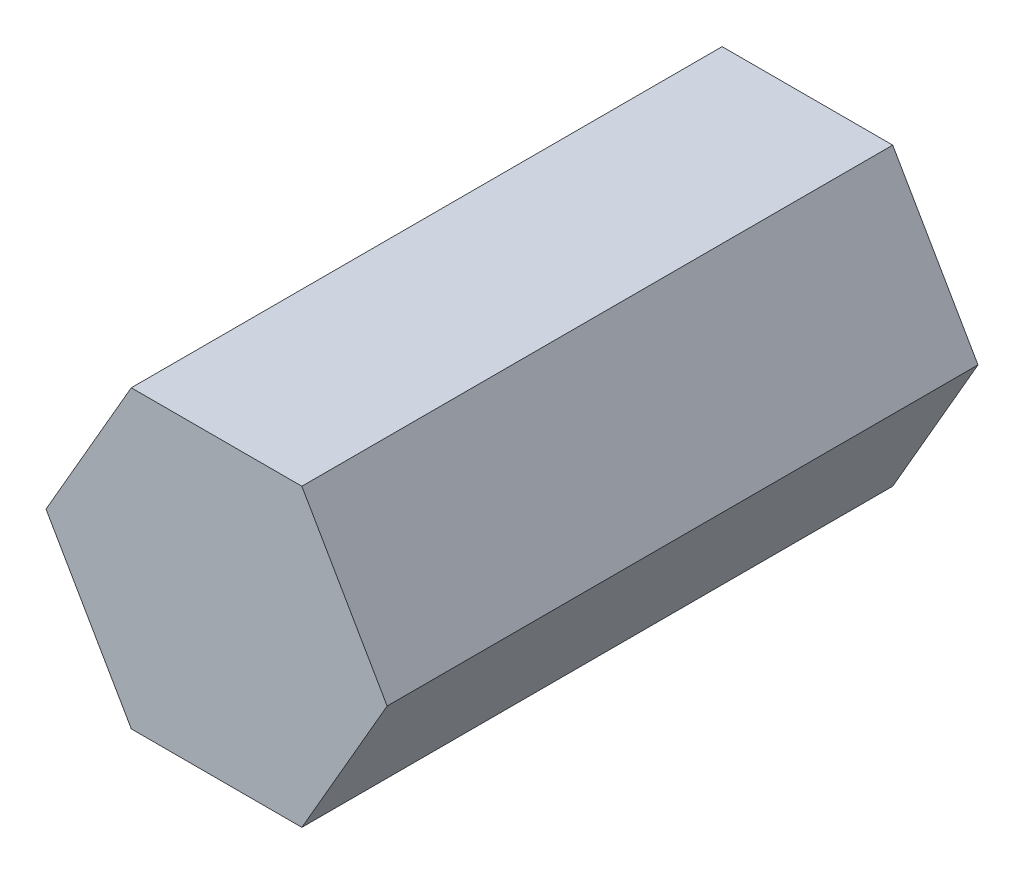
from build123d import *

# Parameters (mm, degrees)
EXTRUSION1_DEPTH = 6


with BuildPart() as part:
    # Esquisse1 → Extrusion1 (new body)
    with BuildSketch(Plane.XY):
        Polygon((1.732050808, 0), (0.866025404, 1.5), (-0.866025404, 1.5), (-1.732050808, 0), (-0.866025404, -1.5), (0.866025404, -1.5), align=None)
    extrude(amount=EXTRUSION1_DEPTH)


solid = part.part
